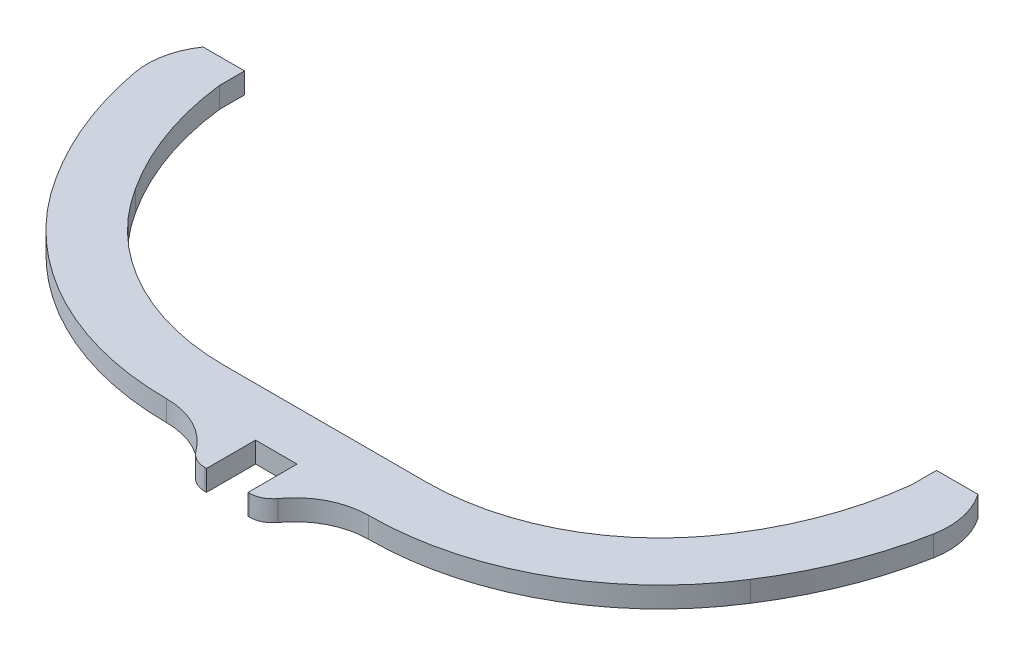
from build123d import *

# Parameters (mm, degrees)
EXTRUDE_1_DEPTH = 9


with BuildPart() as part:
    # Sketch 1 → Extrude 1 (new, symmetric)
    with BuildSketch(Plane(origin=(0, 0, 0), x_dir=(1, 0, 0), z_dir=(0, 1, 0))):
        with BuildLine():
            Line((87.579301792, -450), (-87.579301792, -450))
            ThreePointArc((-87.579301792, -450), (-185.468491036, -424.816615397), (-259.051263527, -355.51963261))
            ThreePointArc((-259.051263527, -355.51963261), (-286.064085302, -301.056313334), (-300, -241.880845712))
            Line((-300, -241.880845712), (-300, -220))
            Line((-300, -220), (-336, -220))
            ThreePointArc((-336, -220), (-346.11350268, -243.403905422), (-346.442498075, -268.897384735))
            ThreePointArc((-346.442498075, -268.897384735), (-329.350896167, -327.897552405), (-301.164181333, -382.474578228))
            ThreePointArc((-301.164181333, -382.474578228), (-209.471390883, -468.67864378), (-87.579301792, -500))
            ThreePointArc((-87.579301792, -500), (-58.372469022, -507.055207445), (-35.606813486, -526.664897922))
            ThreePointArc((-35.606813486, -526.664897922), (-28.490564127, -532.794633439), (-19.360886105, -535))
            Line((-19.360886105, -535), (-18, -535))
            Line((-18, -535), (-18, -492.5))
            Line((-18, -492.5), (18, -492.5))
            Line((18, -492.5), (18, -535))
            Line((18, -535), (19.360886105, -535))
            ThreePointArc((19.360886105, -535), (28.490564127, -532.794633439), (35.606813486, -526.664897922))
            ThreePointArc((35.606813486, -526.664897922), (58.372469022, -507.055207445), (87.579301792, -500))
            ThreePointArc((87.579301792, -500), (209.471390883, -468.67864378), (301.164181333, -382.474578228))
            ThreePointArc((301.164181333, -382.474578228), (329.350896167, -327.897552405), (346.442498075, -268.897384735))
            ThreePointArc((346.442498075, -268.897384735), (346.11350268, -243.403905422), (336, -220))
            Line((336, -220), (300, -220))
            Line((300, -220), (300, -241.880845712))
            ThreePointArc((300, -241.880845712), (286.064085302, -301.056313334), (259.051263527, -355.51963261))
            ThreePointArc((259.051263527, -355.51963261), (185.468491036, -424.816615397), (87.579301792, -450))
        make_face()
    extrude(amount=EXTRUDE_1_DEPTH, both=True)


solid = part.part
